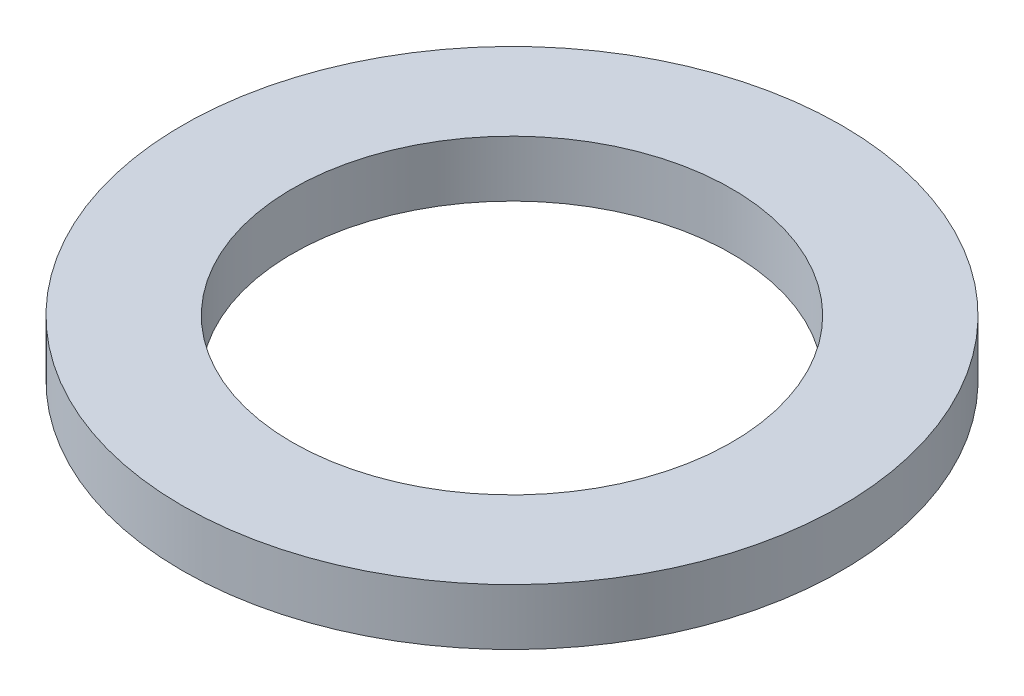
from build123d import *

# Parameters (mm, degrees)
SKETCH1_R           = 2.38125
BOSS_EXTRUDE1_DEPTH = 0.4064
SKETCH5_R           = 1.5875
CUT_EXTRUDE1_DEPTH  = 4.392029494


with BuildPart() as part:
    # Sketch1 → Boss-Extrude1 (new body)
    with BuildSketch(Plane(origin=(0, 0, 0), x_dir=(1, 0, 0), z_dir=(0, 1, 0))):
        with Locations(Location((0, 0, 0), (0, 0, 270))):
            Circle(SKETCH1_R)
    extrude(amount=BOSS_EXTRUDE1_DEPTH)

    # Sketch5 → Cut-Extrude1 (cut, through all)
    with BuildSketch(Plane(origin=(0, 0.4064, 0), x_dir=(-1, 0, 0), z_dir=(0, 1, 0))):
        with Locations(Location((0, 0, 0), (0, 0, 90))):
            Circle(SKETCH5_R)
    extrude(amount=-CUT_EXTRUDE1_DEPTH, mode=Mode.SUBTRACT)


solid = part.part
